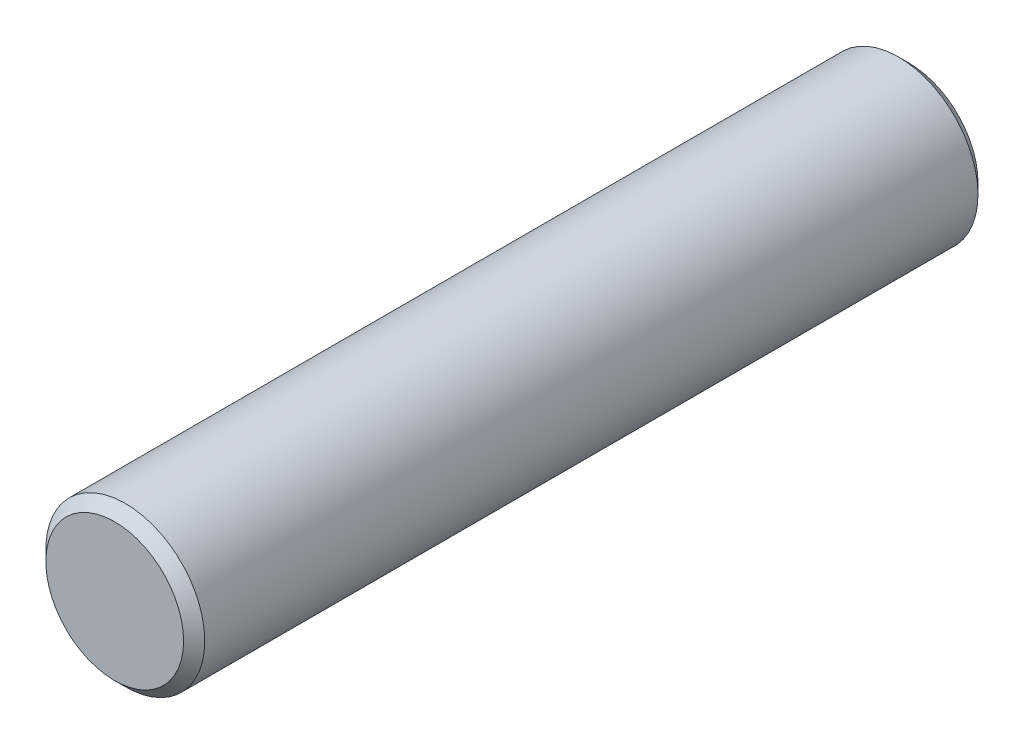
ISO-10303-21;
HEADER;
FILE_DESCRIPTION(('STEP AP214'),'2;1');
FILE_NAME('part.step','',(''),(''),'','','');
FILE_SCHEMA(('AUTOMOTIVE_DESIGN { 1 0 10303 214 1 1 1 1 }'));
ENDSEC;
DATA;
#1=APPLICATION_CONTEXT('core data for automotive mechanical design processes');
#2=APPLICATION_PROTOCOL_DEFINITION('international standard','automotive_design',2000,#1);
#3=PRODUCT_CONTEXT('',#1,'mechanical');
#4=PRODUCT('Part','Part','',(#3));
#5=PRODUCT_RELATED_PRODUCT_CATEGORY('part','',(#4));
#6=PRODUCT_DEFINITION_FORMATION('','',#4);
#7=PRODUCT_DEFINITION_CONTEXT('part definition',#1,'design');
#8=PRODUCT_DEFINITION('design','',#6,#7);
#9=PRODUCT_DEFINITION_SHAPE('','',#8);
#10=(LENGTH_UNIT() NAMED_UNIT(*) SI_UNIT(.MILLI.,.METRE.));
#11=(NAMED_UNIT(*) PLANE_ANGLE_UNIT() SI_UNIT($,.RADIAN.));
#12=(NAMED_UNIT(*) SI_UNIT($,.STERADIAN.) SOLID_ANGLE_UNIT());
#13=UNCERTAINTY_MEASURE_WITH_UNIT(LENGTH_MEASURE(1.E-05),#10,'distance_accuracy_value','');
#14=(GEOMETRIC_REPRESENTATION_CONTEXT(3) GLOBAL_UNCERTAINTY_ASSIGNED_CONTEXT((#13)) GLOBAL_UNIT_ASSIGNED_CONTEXT((#10,
#11,#12)) REPRESENTATION_CONTEXT('',''));
#15=CARTESIAN_POINT('',(0.,0.,0.));
#16=DIRECTION('',(0.,0.,1.));
#17=DIRECTION('',(1.,0.,0.));
#18=AXIS2_PLACEMENT_3D('',#15,#16,#17);
#19=CARTESIAN_POINT('',(0.,0.,75.));
#20=DIRECTION('',(0.,0.,-1.));
#21=DIRECTION('',(-1.,0.,0.));
#22=AXIS2_PLACEMENT_3D('',#19,#20,#21);
#23=CYLINDRICAL_SURFACE('',#22,7.5);
#24=CARTESIAN_POINT('',(0.,0.,74.));
#25=DIRECTION('',(0.,0.,1.));
#26=DIRECTION('',(1.,0.,0.));
#27=AXIS2_PLACEMENT_3D('',#24,#25,#26);
#28=CIRCLE('',#27,7.5);
#29=CARTESIAN_POINT('',(7.5,0.,74.));
#30=VERTEX_POINT('',#29);
#31=EDGE_CURVE('E30',#30,#30,#28,.F.);
#32=ORIENTED_EDGE('',*,*,#31,.T.);
#33=EDGE_LOOP('',(#32));
#34=FACE_BOUND('',#33,.T.);
#35=CARTESIAN_POINT('',(0.,0.,1.));
#36=DIRECTION('',(0.,0.,1.));
#37=DIRECTION('',(1.,0.,0.));
#38=AXIS2_PLACEMENT_3D('',#35,#36,#37);
#39=CIRCLE('',#38,7.5);
#40=CARTESIAN_POINT('',(7.5,0.,1.));
#41=VERTEX_POINT('',#40);
#42=EDGE_CURVE('E34',#41,#41,#39,.T.);
#43=ORIENTED_EDGE('',*,*,#42,.T.);
#44=EDGE_LOOP('',(#43));
#45=FACE_BOUND('',#44,.T.);
#46=ADVANCED_FACE('F24',(#34,#45),#23,.T.);
#47=CARTESIAN_POINT('',(0.,0.,75.));
#48=DIRECTION('',(0.,0.,1.));
#49=DIRECTION('',(1.,0.,0.));
#50=AXIS2_PLACEMENT_3D('',#47,#48,#49);
#51=PLANE('',#50);
#52=CARTESIAN_POINT('',(0.,0.,75.));
#53=DIRECTION('',(0.,0.,1.));
#54=DIRECTION('',(1.,0.,0.));
#55=AXIS2_PLACEMENT_3D('',#52,#53,#54);
#56=CIRCLE('',#55,6.5);
#57=CARTESIAN_POINT('',(6.5,0.,75.));
#58=VERTEX_POINT('',#57);
#59=EDGE_CURVE('E38',#58,#58,#56,.T.);
#60=ORIENTED_EDGE('',*,*,#59,.T.);
#61=EDGE_LOOP('',(#60));
#62=FACE_BOUND('',#61,.T.);
#63=ADVANCED_FACE('F44',(#62),#51,.T.);
#64=CARTESIAN_POINT('',(0.,0.,0.));
#65=DIRECTION('',(0.,0.,1.));
#66=DIRECTION('',(1.,0.,0.));
#67=AXIS2_PLACEMENT_3D('',#64,#65,#66);
#68=PLANE('',#67);
#69=CARTESIAN_POINT('',(0.,0.,0.));
#70=DIRECTION('',(0.,0.,1.));
#71=DIRECTION('',(1.,0.,0.));
#72=AXIS2_PLACEMENT_3D('',#69,#70,#71);
#73=CIRCLE('',#72,6.49999999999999);
#74=CARTESIAN_POINT('',(6.49999999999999,0.,0.));
#75=VERTEX_POINT('',#74);
#76=EDGE_CURVE('E10',#75,#75,#73,.F.);
#77=ORIENTED_EDGE('',*,*,#76,.T.);
#78=EDGE_LOOP('',(#77));
#79=FACE_BOUND('',#78,.T.);
#80=ADVANCED_FACE('F49',(#79),#68,.F.);
#81=CARTESIAN_POINT('',(0.,0.,75.));
#82=DIRECTION('',(0.,0.,-1.));
#83=DIRECTION('',(-1.,0.,0.));
#84=AXIS2_PLACEMENT_3D('',#81,#82,#83);
#85=CONICAL_SURFACE('',#84,6.5,0.785398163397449);
#86=ORIENTED_EDGE('',*,*,#31,.F.);
#87=EDGE_LOOP('',(#86));
#88=FACE_BOUND('',#87,.T.);
#89=ORIENTED_EDGE('',*,*,#59,.F.);
#90=EDGE_LOOP('',(#89));
#91=FACE_BOUND('',#90,.T.);
#92=ADVANCED_FACE('F46',(#88,#91),#85,.T.);
#93=CARTESIAN_POINT('',(0.,0.,1.));
#94=DIRECTION('',(0.,0.,1.));
#95=DIRECTION('',(1.,0.,0.));
#96=AXIS2_PLACEMENT_3D('',#93,#94,#95);
#97=CONICAL_SURFACE('',#96,7.5,0.785398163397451);
#98=ORIENTED_EDGE('',*,*,#76,.F.);
#99=EDGE_LOOP('',(#98));
#100=FACE_BOUND('',#99,.T.);
#101=ORIENTED_EDGE('',*,*,#42,.F.);
#102=EDGE_LOOP('',(#101));
#103=FACE_BOUND('',#102,.T.);
#104=ADVANCED_FACE('F48',(#100,#103),#97,.T.);
#105=CLOSED_SHELL('',(#46,#63,#80,#92,#104));
#106=MANIFOLD_SOLID_BREP('B2',#105);
#107=ADVANCED_BREP_SHAPE_REPRESENTATION('',(#18,#106),#14);
#108=SHAPE_DEFINITION_REPRESENTATION(#9,#107);
ENDSEC;
END-ISO-10303-21;
